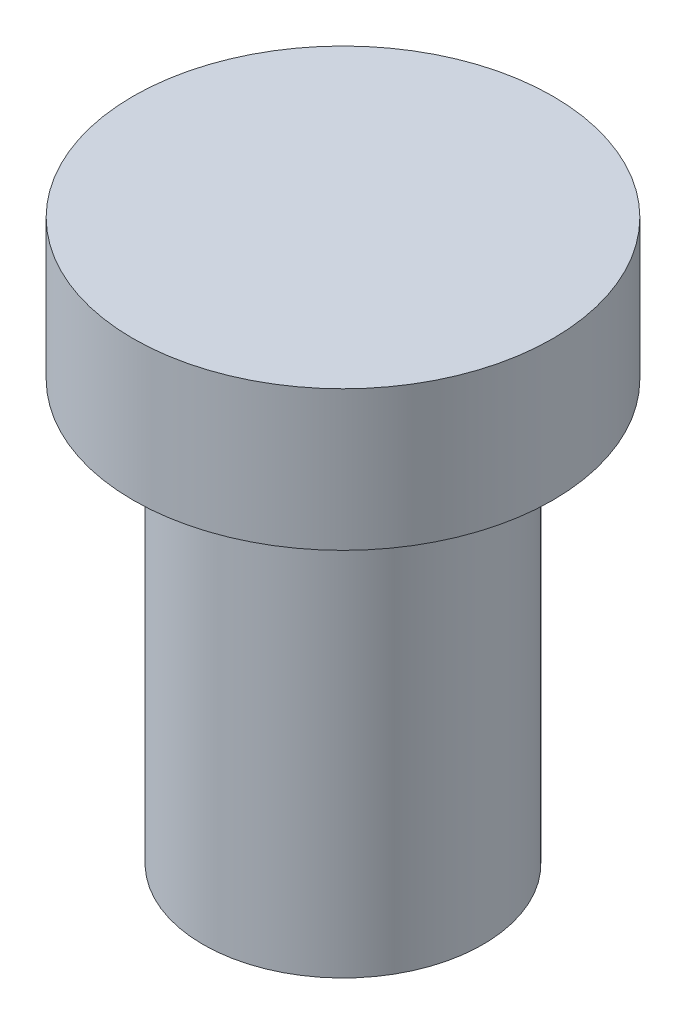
ISO-10303-21;
HEADER;
FILE_DESCRIPTION(('STEP AP214'),'2;1');
FILE_NAME('part.step','',(''),(''),'','','');
FILE_SCHEMA(('AUTOMOTIVE_DESIGN { 1 0 10303 214 1 1 1 1 }'));
ENDSEC;
DATA;
#1=APPLICATION_CONTEXT('core data for automotive mechanical design processes');
#2=APPLICATION_PROTOCOL_DEFINITION('international standard','automotive_design',2000,#1);
#3=PRODUCT_CONTEXT('',#1,'mechanical');
#4=PRODUCT('Part','Part','',(#3));
#5=PRODUCT_RELATED_PRODUCT_CATEGORY('part','',(#4));
#6=PRODUCT_DEFINITION_FORMATION('','',#4);
#7=PRODUCT_DEFINITION_CONTEXT('part definition',#1,'design');
#8=PRODUCT_DEFINITION('design','',#6,#7);
#9=PRODUCT_DEFINITION_SHAPE('','',#8);
#10=(LENGTH_UNIT() NAMED_UNIT(*) SI_UNIT(.MILLI.,.METRE.));
#11=(NAMED_UNIT(*) PLANE_ANGLE_UNIT() SI_UNIT($,.RADIAN.));
#12=(NAMED_UNIT(*) SI_UNIT($,.STERADIAN.) SOLID_ANGLE_UNIT());
#13=UNCERTAINTY_MEASURE_WITH_UNIT(LENGTH_MEASURE(1.E-05),#10,'distance_accuracy_value','');
#14=(GEOMETRIC_REPRESENTATION_CONTEXT(3) GLOBAL_UNCERTAINTY_ASSIGNED_CONTEXT((#13)) GLOBAL_UNIT_ASSIGNED_CONTEXT((#10,
#11,#12)) REPRESENTATION_CONTEXT('',''));
#15=CARTESIAN_POINT('',(0.,0.,0.));
#16=DIRECTION('',(0.,0.,1.));
#17=DIRECTION('',(1.,0.,0.));
#18=AXIS2_PLACEMENT_3D('',#15,#16,#17);
#19=CARTESIAN_POINT('',(0.,0.,0.));
#20=DIRECTION('',(0.,-1.,0.));
#21=DIRECTION('',(0.,0.,-1.));
#22=AXIS2_PLACEMENT_3D('',#19,#20,#21);
#23=PLANE('',#22);
#24=CARTESIAN_POINT('',(0.,0.,0.));
#25=DIRECTION('',(0.,1.,0.));
#26=DIRECTION('',(0.,0.,1.));
#27=AXIS2_PLACEMENT_3D('',#24,#25,#26);
#28=CIRCLE('',#27,7.5);
#29=CARTESIAN_POINT('',(0.,0.,7.5));
#30=VERTEX_POINT('',#29);
#31=EDGE_CURVE('E10',#30,#30,#28,.T.);
#32=ORIENTED_EDGE('',*,*,#31,.T.);
#33=EDGE_LOOP('',(#32));
#34=FACE_BOUND('',#33,.T.);
#35=ADVANCED_FACE('F29',(#34),#23,.F.);
#36=CARTESIAN_POINT('',(0.,22.2547523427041,0.));
#37=DIRECTION('',(0.,1.,0.));
#38=DIRECTION('',(0.,0.,1.));
#39=AXIS2_PLACEMENT_3D('',#36,#37,#38);
#40=CYLINDRICAL_SURFACE('',#39,7.5);
#41=ORIENTED_EDGE('',*,*,#31,.F.);
#42=EDGE_LOOP('',(#41));
#43=FACE_BOUND('',#42,.T.);
#44=CARTESIAN_POINT('',(0.,-5.,0.));
#45=DIRECTION('',(0.,1.,0.));
#46=DIRECTION('',(0.,0.,1.));
#47=AXIS2_PLACEMENT_3D('',#44,#45,#46);
#48=CIRCLE('',#47,7.5);
#49=CARTESIAN_POINT('',(0.,-5.,7.5));
#50=VERTEX_POINT('',#49);
#51=EDGE_CURVE('E35',#50,#50,#48,.T.);
#52=ORIENTED_EDGE('',*,*,#51,.T.);
#53=EDGE_LOOP('',(#52));
#54=FACE_BOUND('',#53,.T.);
#55=ADVANCED_FACE('F61',(#43,#54),#40,.T.);
#56=CARTESIAN_POINT('',(7.5,-5.,0.));
#57=DIRECTION('',(0.,1.,0.));
#58=DIRECTION('',(0.,0.,1.));
#59=AXIS2_PLACEMENT_3D('',#56,#57,#58);
#60=PLANE('',#59);
#61=ORIENTED_EDGE('',*,*,#51,.F.);
#62=EDGE_LOOP('',(#61));
#63=FACE_BOUND('',#62,.T.);
#64=CARTESIAN_POINT('',(0.,-5.,0.));
#65=DIRECTION('',(0.,1.,0.));
#66=DIRECTION('',(0.,0.,1.));
#67=AXIS2_PLACEMENT_3D('',#64,#65,#66);
#68=CIRCLE('',#67,5.);
#69=CARTESIAN_POINT('',(0.,-5.,5.));
#70=VERTEX_POINT('',#69);
#71=EDGE_CURVE('E39',#70,#70,#68,.T.);
#72=ORIENTED_EDGE('',*,*,#71,.T.);
#73=EDGE_LOOP('',(#72));
#74=FACE_BOUND('',#73,.T.);
#75=ADVANCED_FACE('F57',(#63,#74),#60,.F.);
#76=CARTESIAN_POINT('',(0.,22.2547523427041,0.));
#77=DIRECTION('',(0.,1.,0.));
#78=DIRECTION('',(0.,0.,1.));
#79=AXIS2_PLACEMENT_3D('',#76,#77,#78);
#80=CYLINDRICAL_SURFACE('',#79,5.);
#81=ORIENTED_EDGE('',*,*,#71,.F.);
#82=EDGE_LOOP('',(#81));
#83=FACE_BOUND('',#82,.T.);
#84=CARTESIAN_POINT('',(0.,-20.,0.));
#85=DIRECTION('',(0.,1.,0.));
#86=DIRECTION('',(0.,0.,1.));
#87=AXIS2_PLACEMENT_3D('',#84,#85,#86);
#88=CIRCLE('',#87,5.00000000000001);
#89=CARTESIAN_POINT('',(0.,-20.,5.00000000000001));
#90=VERTEX_POINT('',#89);
#91=EDGE_CURVE('E43',#90,#90,#88,.T.);
#92=ORIENTED_EDGE('',*,*,#91,.T.);
#93=EDGE_LOOP('',(#92));
#94=FACE_BOUND('',#93,.T.);
#95=ADVANCED_FACE('F49',(#83,#94),#80,.T.);
#96=CARTESIAN_POINT('',(5.00000000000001,-20.,0.));
#97=DIRECTION('',(0.,1.,0.));
#98=DIRECTION('',(0.,0.,1.));
#99=AXIS2_PLACEMENT_3D('',#96,#97,#98);
#100=PLANE('',#99);
#101=ORIENTED_EDGE('',*,*,#91,.F.);
#102=EDGE_LOOP('',(#101));
#103=FACE_BOUND('',#102,.T.);
#104=ADVANCED_FACE('F51',(#103),#100,.F.);
#105=CLOSED_SHELL('',(#35,#55,#75,#95,#104));
#106=MANIFOLD_SOLID_BREP('B2',#105);
#107=ADVANCED_BREP_SHAPE_REPRESENTATION('',(#18,#106),#14);
#108=SHAPE_DEFINITION_REPRESENTATION(#9,#107);
ENDSEC;
END-ISO-10303-21;
